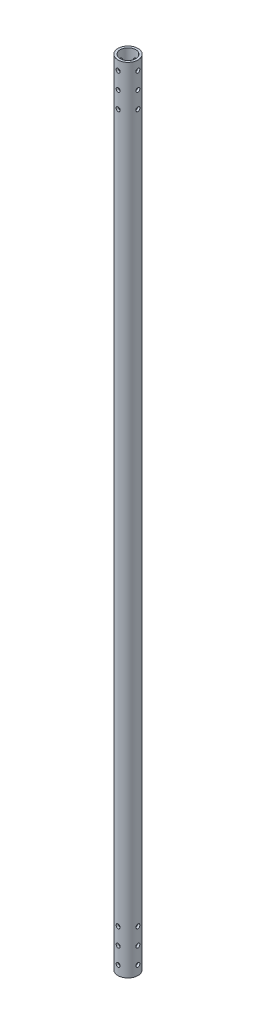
from build123d import *

# Parameters (mm, degrees)
SKETCH1_R                 = 54
SKETCH1_R_2               = 42
BOSS_EXTRUDE1_DEPTH       = 2137
SKETCH2_R                 = 11
CUT_EXTRUDE1_DEPTH        = 100
CIRPATTERN1_COUNT         = 2
CIRPATTERN1_ANGLE         = 90
LPATTERN1_COUNT           = 3
LPATTERN1_PITCH           = 90
LPATTERN1_COPY_1_SKETCH_R = 11
LPATTERN1_COPY_1_DEPTH    = 100
LPATTERN1_COPY_2_SKETCH_R = 11
LPATTERN1_COPY_2_DEPTH    = 100
MIRROR1_COPY_1_SKETCH_R   = 11
MIRROR1_COPY_1_DEPTH      = 100
MIRROR1_COPY_2_SKETCH_R   = 11
MIRROR1_COPY_2_DEPTH      = 100
MIRROR1_COPY_3_SKETCH_R   = 11
MIRROR1_COPY_3_DEPTH      = 100
MIRROR1_COPY_4_SKETCH_R   = 11
MIRROR1_COPY_4_DEPTH      = 100
MIRROR1_COPY_5_SKETCH_R   = 11
MIRROR1_COPY_5_DEPTH      = 100


with BuildPart() as part:
    # Sketch1 → Boss-Extrude1 (new, symmetric)
    with BuildSketch(Plane(origin=(0, 0, 0), x_dir=(1, 0, 0), z_dir=(0, 1, 0))):
        with Locations(Location((0, 0, 0), (0, 0, 270))):
            Circle(SKETCH1_R)
        with Locations(Location((0, 0, 0), (0, 0, 270))):
            Circle(SKETCH1_R_2, mode=Mode.SUBTRACT)
    extrude(amount=BOSS_EXTRUDE1_DEPTH, both=True)

    # Sketch2 → Cut-Extrude1 (cut, symmetric)
    with BuildSketch(Plane.XY):
        with Locations((0, -2087)):
            Circle(SKETCH2_R)
    cut_extrude1 = extrude(amount=CUT_EXTRUDE1_DEPTH, both=True, mode=Mode.SUBTRACT)

    # CirPattern1: Cut-Extrude1 ×2 about axis
    cirpattern1_axis = Axis((0, 2137, 0), (0, -1, 0))
    for i in range(1, CIRPATTERN1_COUNT):
        add(cut_extrude1.rotate(cirpattern1_axis, i * CIRPATTERN1_ANGLE / (CIRPATTERN1_COUNT - 1)), mode=Mode.SUBTRACT)

    # LPattern1: Cut-Extrude1 ×3
    with Locations(*[(0, i * LPATTERN1_PITCH, 0) for i in range(1, LPATTERN1_COUNT)]):
        add(cut_extrude1, mode=Mode.SUBTRACT)

    # LPattern1 copy 1 sketch → LPattern1 copy 1 (cut, symmetric)
    with BuildSketch(Plane(origin=(0, 90, 0), x_dir=(0, 0, 1), z_dir=(-1, 0, 0))):
        with Locations((0, -2087)):
            Circle(LPATTERN1_COPY_1_SKETCH_R)
    extrude(amount=LPATTERN1_COPY_1_DEPTH, both=True, mode=Mode.SUBTRACT)

    # LPattern1 copy 2 sketch → LPattern1 copy 2 (cut, symmetric)
    with BuildSketch(Plane(origin=(0, 180, 0), x_dir=(0, 0, 1), z_dir=(-1, 0, 0))):
        with Locations((0, -2087)):
            Circle(LPATTERN1_COPY_2_SKETCH_R)
    extrude(amount=LPATTERN1_COPY_2_DEPTH, both=True, mode=Mode.SUBTRACT)

    # Mirror1: Cut-Extrude1 across plane
    add(cut_extrude1.mirror(Plane.ZX), mode=Mode.SUBTRACT)

    # Mirror1 copy 1 sketch → Mirror1 copy 1 (cut, symmetric)
    with BuildSketch(Plane.ZY):
        with Locations((0, 2087)):
            Circle(MIRROR1_COPY_1_SKETCH_R)
    extrude(amount=MIRROR1_COPY_1_DEPTH, both=True, mode=Mode.SUBTRACT)

    # Mirror1 copy 2 sketch → Mirror1 copy 2 (cut, symmetric)
    with BuildSketch(Plane(origin=(0, -90, 0), x_dir=(1, 0, 0), z_dir=(0, 0, 1))):
        with Locations((0, 2087)):
            Circle(MIRROR1_COPY_2_SKETCH_R)
    extrude(amount=MIRROR1_COPY_2_DEPTH, both=True, mode=Mode.SUBTRACT)

    # Mirror1 copy 3 sketch → Mirror1 copy 3 (cut, symmetric)
    with BuildSketch(Plane(origin=(0, -180, 0), x_dir=(1, 0, 0), z_dir=(0, 0, 1))):
        with Locations((0, 2087)):
            Circle(MIRROR1_COPY_3_SKETCH_R)
    extrude(amount=MIRROR1_COPY_3_DEPTH, both=True, mode=Mode.SUBTRACT)

    # Mirror1 copy 4 sketch → Mirror1 copy 4 (cut, symmetric)
    with BuildSketch(Plane(origin=(0, -90, 0), x_dir=(0, 0, 1), z_dir=(-1, 0, 0))):
        with Locations((0, 2087)):
            Circle(MIRROR1_COPY_4_SKETCH_R)
    extrude(amount=MIRROR1_COPY_4_DEPTH, both=True, mode=Mode.SUBTRACT)

    # Mirror1 copy 5 sketch → Mirror1 copy 5 (cut, symmetric)
    with BuildSketch(Plane(origin=(0, -180, 0), x_dir=(0, 0, 1), z_dir=(-1, 0, 0))):
        with Locations((0, 2087)):
            Circle(MIRROR1_COPY_5_SKETCH_R)
    extrude(amount=MIRROR1_COPY_5_DEPTH, both=True, mode=Mode.SUBTRACT)


solid = part.part
